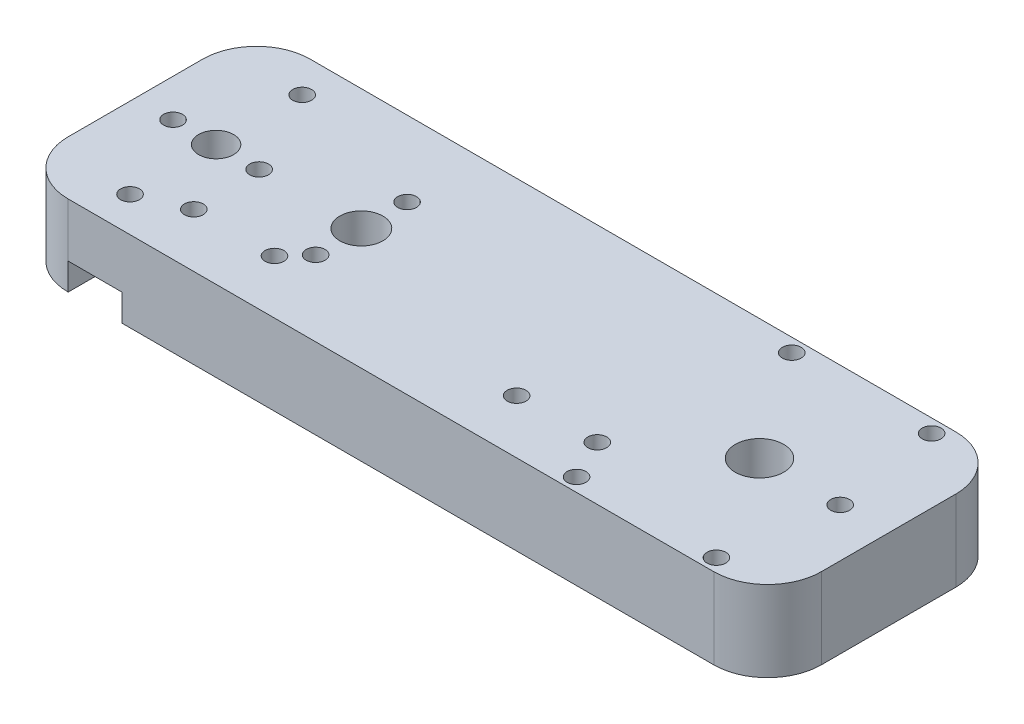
ISO-10303-21;
HEADER;
FILE_DESCRIPTION(('STEP AP214'),'2;1');
FILE_NAME('part.step','',(''),(''),'','','');
FILE_SCHEMA(('AUTOMOTIVE_DESIGN { 1 0 10303 214 1 1 1 1 }'));
ENDSEC;
DATA;
#1=APPLICATION_CONTEXT('core data for automotive mechanical design processes');
#2=APPLICATION_PROTOCOL_DEFINITION('international standard','automotive_design',2000,#1);
#3=PRODUCT_CONTEXT('',#1,'mechanical');
#4=PRODUCT('Part','Part','',(#3));
#5=PRODUCT_RELATED_PRODUCT_CATEGORY('part','',(#4));
#6=PRODUCT_DEFINITION_FORMATION('','',#4);
#7=PRODUCT_DEFINITION_CONTEXT('part definition',#1,'design');
#8=PRODUCT_DEFINITION('design','',#6,#7);
#9=PRODUCT_DEFINITION_SHAPE('','',#8);
#10=(LENGTH_UNIT() NAMED_UNIT(*) SI_UNIT(.MILLI.,.METRE.));
#11=(NAMED_UNIT(*) PLANE_ANGLE_UNIT() SI_UNIT($,.RADIAN.));
#12=(NAMED_UNIT(*) SI_UNIT($,.STERADIAN.) SOLID_ANGLE_UNIT());
#13=UNCERTAINTY_MEASURE_WITH_UNIT(LENGTH_MEASURE(1.E-05),#10,'distance_accuracy_value','');
#14=(GEOMETRIC_REPRESENTATION_CONTEXT(3) GLOBAL_UNCERTAINTY_ASSIGNED_CONTEXT((#13)) GLOBAL_UNIT_ASSIGNED_CONTEXT((#10,
#11,#12)) REPRESENTATION_CONTEXT('',''));
#15=CARTESIAN_POINT('',(0.,0.,0.));
#16=DIRECTION('',(0.,0.,1.));
#17=DIRECTION('',(1.,0.,0.));
#18=AXIS2_PLACEMENT_3D('',#15,#16,#17);
#19=CARTESIAN_POINT('',(0.,0.,0.));
#20=DIRECTION('',(0.,-1.,0.));
#21=DIRECTION('',(0.,0.,-1.));
#22=AXIS2_PLACEMENT_3D('',#19,#20,#21);
#23=PLANE('',#22);
#24=CARTESIAN_POINT('',(46.,0.,0.));
#25=DIRECTION('',(0.,-1.,0.));
#26=DIRECTION('',(0.,0.,-1.));
#27=AXIS2_PLACEMENT_3D('',#24,#25,#26);
#28=CIRCLE('',#27,4.5);
#29=CARTESIAN_POINT('',(46.,0.,-4.5));
#30=VERTEX_POINT('',#29);
#31=EDGE_CURVE('E341',#30,#30,#28,.F.);
#32=ORIENTED_EDGE('',*,*,#31,.T.);
#33=EDGE_LOOP('',(#32));
#34=FACE_BOUND('',#33,.T.);
#35=CARTESIAN_POINT('',(46.,0.,0.));
#36=DIRECTION('',(0.,-1.,0.));
#37=DIRECTION('',(0.,0.,-1.));
#38=AXIS2_PLACEMENT_3D('',#35,#36,#37);
#39=CIRCLE('',#38,8.00000000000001);
#40=CARTESIAN_POINT('',(46.,0.,-8.));
#41=VERTEX_POINT('',#40);
#42=EDGE_CURVE('E491',#41,#41,#39,.F.);
#43=ORIENTED_EDGE('',*,*,#42,.F.);
#44=EDGE_LOOP('',(#43));
#45=FACE_BOUND('',#44,.T.);
#46=ADVANCED_FACE('F49',(#34,#45),#23,.T.);
#47=CARTESIAN_POINT('',(28.3533515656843,0.,12.5));
#48=DIRECTION('',(0.,1.,0.));
#49=DIRECTION('',(0.,0.,1.));
#50=AXIS2_PLACEMENT_3D('',#47,#48,#49);
#51=CIRCLE('',#50,1.75);
#52=CARTESIAN_POINT('',(28.3533515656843,0.,14.25));
#53=VERTEX_POINT('',#52);
#54=EDGE_CURVE('E749',#53,#53,#51,.T.);
#55=ORIENTED_EDGE('',*,*,#54,.T.);
#56=EDGE_LOOP('',(#55));
#57=FACE_BOUND('',#56,.T.);
#58=CARTESIAN_POINT('',(13.3533515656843,0.,12.5000000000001));
#59=DIRECTION('',(0.,1.,0.));
#60=DIRECTION('',(0.,0.,1.));
#61=AXIS2_PLACEMENT_3D('',#58,#59,#60);
#62=CIRCLE('',#61,1.75);
#63=CARTESIAN_POINT('',(13.3533515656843,0.,14.2500000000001));
#64=VERTEX_POINT('',#63);
#65=EDGE_CURVE('E761',#64,#64,#62,.T.);
#66=ORIENTED_EDGE('',*,*,#65,.T.);
#67=EDGE_LOOP('',(#66));
#68=FACE_BOUND('',#67,.T.);
#69=CARTESIAN_POINT('',(-31.6466484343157,0.,12.5000000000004));
#70=DIRECTION('',(0.,1.,0.));
#71=DIRECTION('',(0.,0.,1.));
#72=AXIS2_PLACEMENT_3D('',#69,#70,#71);
#73=CIRCLE('',#72,1.75);
#74=CARTESIAN_POINT('',(-31.6466484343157,0.,14.2500000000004));
#75=VERTEX_POINT('',#74);
#76=EDGE_CURVE('E769',#75,#75,#73,.T.);
#77=ORIENTED_EDGE('',*,*,#76,.T.);
#78=EDGE_LOOP('',(#77));
#79=FACE_BOUND('',#78,.T.);
#80=CARTESIAN_POINT('',(-46.6466484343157,0.,12.5000000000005));
#81=DIRECTION('',(0.,1.,0.));
#82=DIRECTION('',(0.,0.,1.));
#83=AXIS2_PLACEMENT_3D('',#80,#81,#82);
#84=CIRCLE('',#83,1.75);
#85=CARTESIAN_POINT('',(-46.6466484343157,0.,14.2500000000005));
#86=VERTEX_POINT('',#85);
#87=EDGE_CURVE('E777',#86,#86,#84,.T.);
#88=ORIENTED_EDGE('',*,*,#87,.T.);
#89=EDGE_LOOP('',(#88));
#90=FACE_BOUND('',#89,.T.);
#91=CARTESIAN_POINT('',(61.,0.,0.));
#92=DIRECTION('',(0.,-1.,0.));
#93=DIRECTION('',(0.,0.,-1.));
#94=AXIS2_PLACEMENT_3D('',#91,#92,#93);
#95=CIRCLE('',#94,1.75);
#96=CARTESIAN_POINT('',(61.,0.,-1.74999999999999));
#97=VERTEX_POINT('',#96);
#98=EDGE_CURVE('E745',#97,#97,#95,.F.);
#99=ORIENTED_EDGE('',*,*,#98,.T.);
#100=EDGE_LOOP('',(#99));
#101=FACE_BOUND('',#100,.T.);
#102=CARTESIAN_POINT('',(46.,0.,0.));
#103=DIRECTION('',(0.,-1.,0.));
#104=DIRECTION('',(0.,0.,-1.));
#105=AXIS2_PLACEMENT_3D('',#102,#103,#104);
#106=CIRCLE('',#105,12.5);
#107=CARTESIAN_POINT('',(46.,0.,-12.5));
#108=VERTEX_POINT('',#107);
#109=EDGE_CURVE('E11',#108,#108,#106,.F.);
#110=ORIENTED_EDGE('',*,*,#109,.T.);
#111=EDGE_LOOP('',(#110));
#112=FACE_BOUND('',#111,.T.);
#113=CARTESIAN_POINT('',(-28.,0.,8.5));
#114=DIRECTION('',(0.,-1.,0.));
#115=DIRECTION('',(0.,0.,-1.));
#116=AXIS2_PLACEMENT_3D('',#113,#114,#115);
#117=CIRCLE('',#116,1.75);
#118=CARTESIAN_POINT('',(-28.,0.,6.75));
#119=VERTEX_POINT('',#118);
#120=EDGE_CURVE('E308',#119,#119,#117,.T.);
#121=ORIENTED_EDGE('',*,*,#120,.F.);
#122=EDGE_LOOP('',(#121));
#123=FACE_BOUND('',#122,.T.);
#124=CARTESIAN_POINT('',(-28.,0.,0.));
#125=DIRECTION('',(0.,-1.,0.));
#126=DIRECTION('',(0.,0.,-1.));
#127=AXIS2_PLACEMENT_3D('',#124,#125,#126);
#128=CIRCLE('',#127,3.99999999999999);
#129=CARTESIAN_POINT('',(-28.,0.,-3.99999999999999));
#130=VERTEX_POINT('',#129);
#131=EDGE_CURVE('E318',#130,#130,#128,.T.);
#132=ORIENTED_EDGE('',*,*,#131,.F.);
#133=EDGE_LOOP('',(#132));
#134=FACE_BOUND('',#133,.T.);
#135=CARTESIAN_POINT('',(-28.,0.,-8.5));
#136=DIRECTION('',(0.,-1.,0.));
#137=DIRECTION('',(0.,0.,-1.));
#138=AXIS2_PLACEMENT_3D('',#135,#136,#137);
#139=CIRCLE('',#138,1.75);
#140=CARTESIAN_POINT('',(-28.,0.,-10.25));
#141=VERTEX_POINT('',#140);
#142=EDGE_CURVE('E307',#141,#141,#139,.T.);
#143=ORIENTED_EDGE('',*,*,#142,.F.);
#144=EDGE_LOOP('',(#143));
#145=FACE_BOUND('',#144,.T.);
#146=CARTESIAN_POINT('',(-47.,0.,0.));
#147=DIRECTION('',(0.,-1.,0.));
#148=DIRECTION('',(0.,0.,-1.));
#149=AXIS2_PLACEMENT_3D('',#146,#147,#148);
#150=CIRCLE('',#149,1.75);
#151=CARTESIAN_POINT('',(-47.,0.,-1.74999999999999));
#152=VERTEX_POINT('',#151);
#153=EDGE_CURVE('E332',#152,#152,#150,.T.);
#154=ORIENTED_EDGE('',*,*,#153,.F.);
#155=EDGE_LOOP('',(#154));
#156=FACE_BOUND('',#155,.T.);
#157=CARTESIAN_POINT('',(-55.,0.,16.));
#158=DIRECTION('',(0.,-1.,0.));
#159=DIRECTION('',(0.,0.,-1.));
#160=AXIS2_PLACEMENT_3D('',#157,#158,#159);
#161=CIRCLE('',#160,1.75);
#162=CARTESIAN_POINT('',(-55.,0.,14.25));
#163=VERTEX_POINT('',#162);
#164=EDGE_CURVE('E342',#163,#163,#161,.T.);
#165=ORIENTED_EDGE('',*,*,#164,.F.);
#166=EDGE_LOOP('',(#165));
#167=FACE_BOUND('',#166,.T.);
#168=CARTESIAN_POINT('',(-63.,0.,0.));
#169=DIRECTION('',(0.,-1.,0.));
#170=DIRECTION('',(0.,0.,-1.));
#171=AXIS2_PLACEMENT_3D('',#168,#169,#170);
#172=CIRCLE('',#171,1.75);
#173=CARTESIAN_POINT('',(-63.,0.,-1.75));
#174=VERTEX_POINT('',#173);
#175=EDGE_CURVE('E350',#174,#174,#172,.T.);
#176=ORIENTED_EDGE('',*,*,#175,.F.);
#177=EDGE_LOOP('',(#176));
#178=FACE_BOUND('',#177,.T.);
#179=CARTESIAN_POINT('',(-55.,0.,-16.));
#180=DIRECTION('',(0.,-1.,0.));
#181=DIRECTION('',(0.,0.,-1.));
#182=AXIS2_PLACEMENT_3D('',#179,#180,#181);
#183=CIRCLE('',#182,1.75);
#184=CARTESIAN_POINT('',(-55.,0.,-17.75));
#185=VERTEX_POINT('',#184);
#186=EDGE_CURVE('E317',#185,#185,#183,.T.);
#187=ORIENTED_EDGE('',*,*,#186,.F.);
#188=EDGE_LOOP('',(#187));
#189=FACE_BOUND('',#188,.T.);
#190=CARTESIAN_POINT('',(-55.,0.,0.));
#191=DIRECTION('',(0.,-1.,0.));
#192=DIRECTION('',(0.,0.,-1.));
#193=AXIS2_PLACEMENT_3D('',#190,#191,#192);
#194=CIRCLE('',#193,3.25000000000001);
#195=CARTESIAN_POINT('',(-55.,0.,-3.25000000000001));
#196=VERTEX_POINT('',#195);
#197=EDGE_CURVE('E368',#196,#196,#194,.T.);
#198=ORIENTED_EDGE('',*,*,#197,.F.);
#199=EDGE_LOOP('',(#198));
#200=FACE_BOUND('',#199,.T.);
#201=DIRECTION('',(0.,0.,-1.));
#202=VECTOR('',#201,1.);
#203=CARTESIAN_POINT('',(67.,0.,-17.5));
#204=LINE('',#203,#202);
#205=CARTESIAN_POINT('',(67.,0.,7.49999999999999));
#206=VERTEX_POINT('',#205);
#207=CARTESIAN_POINT('',(67.,0.,-7.5));
#208=VERTEX_POINT('',#207);
#209=EDGE_CURVE('E282',#206,#208,#204,.T.);
#210=ORIENTED_EDGE('',*,*,#209,.F.);
#211=CARTESIAN_POINT('',(57.,0.,7.49999999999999));
#212=DIRECTION('',(0.,-1.,0.));
#213=DIRECTION('',(0.,0.,-1.));
#214=AXIS2_PLACEMENT_3D('',#211,#212,#213);
#215=CIRCLE('',#214,10.);
#216=CARTESIAN_POINT('',(57.,0.,17.5));
#217=VERTEX_POINT('',#216);
#218=EDGE_CURVE('E464',#206,#217,#215,.T.);
#219=ORIENTED_EDGE('',*,*,#218,.T.);
#220=DIRECTION('',(1.,0.,0.));
#221=VECTOR('',#220,1.);
#222=CARTESIAN_POINT('',(-50.,0.,17.5));
#223=LINE('',#222,#221);
#224=CARTESIAN_POINT('',(-50.,0.,17.5));
#225=VERTEX_POINT('',#224);
#226=EDGE_CURVE('E278',#225,#217,#223,.T.);
#227=ORIENTED_EDGE('',*,*,#226,.F.);
#228=DIRECTION('',(0.,0.,-1.));
#229=VECTOR('',#228,1.);
#230=CARTESIAN_POINT('',(-50.,0.,22.5));
#231=LINE('',#230,#229);
#232=CARTESIAN_POINT('',(-50.,0.,22.5));
#233=VERTEX_POINT('',#232);
#234=EDGE_CURVE('E237',#233,#225,#231,.T.);
#235=ORIENTED_EDGE('',*,*,#234,.F.);
#236=DIRECTION('',(1.,0.,0.));
#237=VECTOR('',#236,1.);
#238=CARTESIAN_POINT('',(-70.,0.,22.5));
#239=LINE('',#238,#237);
#240=CARTESIAN_POINT('',(-60.,0.,22.5));
#241=VERTEX_POINT('',#240);
#242=EDGE_CURVE('E220',#241,#233,#239,.T.);
#243=ORIENTED_EDGE('',*,*,#242,.F.);
#244=DIRECTION('',(0.,0.,1.));
#245=VECTOR('',#244,1.);
#246=CARTESIAN_POINT('',(-60.,0.,22.5));
#247=LINE('',#246,#245);
#248=CARTESIAN_POINT('',(-60.,0.,17.5));
#249=VERTEX_POINT('',#248);
#250=EDGE_CURVE('E210',#249,#241,#247,.T.);
#251=ORIENTED_EDGE('',*,*,#250,.F.);
#252=CARTESIAN_POINT('',(-57.,0.,7.96060798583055));
#253=DIRECTION('',(0.,-1.,0.));
#254=DIRECTION('',(0.,0.,-1.));
#255=AXIS2_PLACEMENT_3D('',#252,#253,#254);
#256=CIRCLE('',#255,10.);
#257=CARTESIAN_POINT('',(-67.,0.,7.96060798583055));
#258=VERTEX_POINT('',#257);
#259=EDGE_CURVE('E193',#249,#258,#256,.T.);
#260=ORIENTED_EDGE('',*,*,#259,.T.);
#261=DIRECTION('',(0.,0.,1.));
#262=VECTOR('',#261,1.);
#263=CARTESIAN_POINT('',(-67.,0.,-17.5));
#264=LINE('',#263,#262);
#265=CARTESIAN_POINT('',(-67.,0.,-7.96060798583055));
#266=VERTEX_POINT('',#265);
#267=EDGE_CURVE('E222',#266,#258,#264,.T.);
#268=ORIENTED_EDGE('',*,*,#267,.F.);
#269=CARTESIAN_POINT('',(-57.,0.,-7.96060798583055));
#270=DIRECTION('',(0.,-1.,0.));
#271=DIRECTION('',(0.,0.,-1.));
#272=AXIS2_PLACEMENT_3D('',#269,#270,#271);
#273=CIRCLE('',#272,10.);
#274=CARTESIAN_POINT('',(-60.,0.,-17.5));
#275=VERTEX_POINT('',#274);
#276=EDGE_CURVE('E202',#266,#275,#273,.T.);
#277=ORIENTED_EDGE('',*,*,#276,.T.);
#278=DIRECTION('',(0.,0.,1.));
#279=VECTOR('',#278,1.);
#280=CARTESIAN_POINT('',(-60.,0.,-22.5));
#281=LINE('',#280,#279);
#282=CARTESIAN_POINT('',(-60.,0.,-22.5));
#283=VERTEX_POINT('',#282);
#284=EDGE_CURVE('E227',#283,#275,#281,.T.);
#285=ORIENTED_EDGE('',*,*,#284,.F.);
#286=DIRECTION('',(-1.,0.,0.));
#287=VECTOR('',#286,1.);
#288=CARTESIAN_POINT('',(-70.,0.,-22.5));
#289=LINE('',#288,#287);
#290=CARTESIAN_POINT('',(-50.,0.,-22.5));
#291=VERTEX_POINT('',#290);
#292=EDGE_CURVE('E379',#291,#283,#289,.T.);
#293=ORIENTED_EDGE('',*,*,#292,.F.);
#294=DIRECTION('',(0.,0.,-1.));
#295=VECTOR('',#294,1.);
#296=CARTESIAN_POINT('',(-50.,0.,-22.5));
#297=LINE('',#296,#295);
#298=CARTESIAN_POINT('',(-50.,0.,-17.5));
#299=VERTEX_POINT('',#298);
#300=EDGE_CURVE('E249',#299,#291,#297,.T.);
#301=ORIENTED_EDGE('',*,*,#300,.F.);
#302=DIRECTION('',(-1.,0.,0.));
#303=VECTOR('',#302,1.);
#304=CARTESIAN_POINT('',(-50.,0.,-17.5));
#305=LINE('',#304,#303);
#306=CARTESIAN_POINT('',(57.,0.,-17.5));
#307=VERTEX_POINT('',#306);
#308=EDGE_CURVE('E286',#307,#299,#305,.T.);
#309=ORIENTED_EDGE('',*,*,#308,.F.);
#310=CARTESIAN_POINT('',(57.,0.,-7.5));
#311=DIRECTION('',(0.,-1.,0.));
#312=DIRECTION('',(0.,0.,-1.));
#313=AXIS2_PLACEMENT_3D('',#310,#311,#312);
#314=CIRCLE('',#313,10.);
#315=EDGE_CURVE('E461',#307,#208,#314,.T.);
#316=ORIENTED_EDGE('',*,*,#315,.T.);
#317=EDGE_LOOP('',(#210,#219,#227,#235,#243,#251,#260,#268,#277,#285,#293,#301,#309,#316));
#318=FACE_BOUND('',#317,.T.);
#319=ADVANCED_FACE('F218',(#57,#68,#79,#90,#101,#112,#123,#134,#145,#156,#167,#178,#189,#200,
#318),#23,.T.);
#320=CARTESIAN_POINT('',(70.,10.,22.5));
#321=DIRECTION('',(-1.,0.,0.));
#322=DIRECTION('',(0.,0.,1.));
#323=AXIS2_PLACEMENT_3D('',#320,#321,#322);
#324=PLANE('',#323);
#325=DIRECTION('',(0.,0.,1.));
#326=VECTOR('',#325,1.);
#327=CARTESIAN_POINT('',(70.,-5.,-22.5));
#328=LINE('',#327,#326);
#329=CARTESIAN_POINT('',(70.,-5.,-12.5));
#330=VERTEX_POINT('',#329);
#331=CARTESIAN_POINT('',(70.,-5.,12.5));
#332=VERTEX_POINT('',#331);
#333=EDGE_CURVE('E270',#330,#332,#328,.T.);
#334=ORIENTED_EDGE('',*,*,#333,.F.);
#335=DIRECTION('',(0.,-1.,0.));
#336=VECTOR('',#335,1.);
#337=CARTESIAN_POINT('',(70.,10.,-12.5));
#338=LINE('',#337,#336);
#339=CARTESIAN_POINT('',(70.,10.,-12.5));
#340=VERTEX_POINT('',#339);
#341=EDGE_CURVE('E450',#330,#340,#338,.F.);
#342=ORIENTED_EDGE('',*,*,#341,.T.);
#343=DIRECTION('',(0.,0.,-1.));
#344=VECTOR('',#343,1.);
#345=CARTESIAN_POINT('',(70.,10.,22.5));
#346=LINE('',#345,#344);
#347=CARTESIAN_POINT('',(70.,10.,12.5));
#348=VERTEX_POINT('',#347);
#349=EDGE_CURVE('E380',#348,#340,#346,.T.);
#350=ORIENTED_EDGE('',*,*,#349,.F.);
#351=DIRECTION('',(0.,-1.,0.));
#352=VECTOR('',#351,1.);
#353=CARTESIAN_POINT('',(70.,10.,12.5));
#354=LINE('',#353,#352);
#355=EDGE_CURVE('E446',#348,#332,#354,.T.);
#356=ORIENTED_EDGE('',*,*,#355,.T.);
#357=EDGE_LOOP('',(#334,#342,#350,#356));
#358=FACE_BOUND('',#357,.T.);
#359=ADVANCED_FACE('F521',(#358),#324,.F.);
#360=CARTESIAN_POINT('',(-70.,10.,-22.5));
#361=DIRECTION('',(0.,0.,1.));
#362=DIRECTION('',(1.,0.,0.));
#363=AXIS2_PLACEMENT_3D('',#360,#361,#362);
#364=PLANE('',#363);
#365=ORIENTED_EDGE('',*,*,#292,.T.);
#366=DIRECTION('',(0.,-1.,0.));
#367=VECTOR('',#366,1.);
#368=CARTESIAN_POINT('',(-60.,10.,-22.5));
#369=LINE('',#368,#367);
#370=CARTESIAN_POINT('',(-60.,10.,-22.5));
#371=VERTEX_POINT('',#370);
#372=EDGE_CURVE('E437',#283,#371,#369,.F.);
#373=ORIENTED_EDGE('',*,*,#372,.T.);
#374=DIRECTION('',(-1.,0.,0.));
#375=VECTOR('',#374,1.);
#376=CARTESIAN_POINT('',(-70.,10.,-22.5));
#377=LINE('',#376,#375);
#378=CARTESIAN_POINT('',(60.,10.,-22.5));
#379=VERTEX_POINT('',#378);
#380=EDGE_CURVE('E384',#379,#371,#377,.T.);
#381=ORIENTED_EDGE('',*,*,#380,.F.);
#382=DIRECTION('',(0.,-1.,0.));
#383=VECTOR('',#382,1.);
#384=CARTESIAN_POINT('',(60.,10.,-22.5));
#385=LINE('',#384,#383);
#386=CARTESIAN_POINT('',(60.,-5.,-22.5));
#387=VERTEX_POINT('',#386);
#388=EDGE_CURVE('E433',#379,#387,#385,.T.);
#389=ORIENTED_EDGE('',*,*,#388,.T.);
#390=DIRECTION('',(1.,0.,0.));
#391=VECTOR('',#390,1.);
#392=CARTESIAN_POINT('',(-50.,-5.,-22.5));
#393=LINE('',#392,#391);
#394=CARTESIAN_POINT('',(-50.,-5.,-22.5));
#395=VERTEX_POINT('',#394);
#396=EDGE_CURVE('E266',#395,#387,#393,.T.);
#397=ORIENTED_EDGE('',*,*,#396,.F.);
#398=DIRECTION('',(0.,1.,0.));
#399=VECTOR('',#398,1.);
#400=CARTESIAN_POINT('',(-50.,-5.,-22.5));
#401=LINE('',#400,#399);
#402=EDGE_CURVE('E274',#395,#291,#401,.T.);
#403=ORIENTED_EDGE('',*,*,#402,.T.);
#404=EDGE_LOOP('',(#365,#373,#381,#389,#397,#403));
#405=FACE_BOUND('',#404,.T.);
#406=ADVANCED_FACE('F535',(#405),#364,.F.);
#407=CARTESIAN_POINT('',(-70.,10.,22.5));
#408=DIRECTION('',(1.,0.,0.));
#409=DIRECTION('',(0.,0.,-1.));
#410=AXIS2_PLACEMENT_3D('',#407,#408,#409);
#411=PLANE('',#410);
#412=DIRECTION('',(0.,0.,-1.));
#413=VECTOR('',#412,1.);
#414=CARTESIAN_POINT('',(-70.,-5.,-22.5));
#415=LINE('',#414,#413);
#416=CARTESIAN_POINT('',(-70.,-5.,12.5));
#417=VERTEX_POINT('',#416);
#418=CARTESIAN_POINT('',(-70.,-5.,-12.5));
#419=VERTEX_POINT('',#418);
#420=EDGE_CURVE('E223',#417,#419,#415,.T.);
#421=ORIENTED_EDGE('',*,*,#420,.F.);
#422=DIRECTION('',(0.,-1.,0.));
#423=VECTOR('',#422,1.);
#424=CARTESIAN_POINT('',(-70.,10.,12.5));
#425=LINE('',#424,#423);
#426=CARTESIAN_POINT('',(-70.,10.,12.5));
#427=VERTEX_POINT('',#426);
#428=EDGE_CURVE('E418',#417,#427,#425,.F.);
#429=ORIENTED_EDGE('',*,*,#428,.T.);
#430=DIRECTION('',(0.,0.,1.));
#431=VECTOR('',#430,1.);
#432=CARTESIAN_POINT('',(-70.,10.,22.5));
#433=LINE('',#432,#431);
#434=CARTESIAN_POINT('',(-70.,10.,-12.5));
#435=VERTEX_POINT('',#434);
#436=EDGE_CURVE('E388',#435,#427,#433,.T.);
#437=ORIENTED_EDGE('',*,*,#436,.F.);
#438=DIRECTION('',(0.,-1.,0.));
#439=VECTOR('',#438,1.);
#440=CARTESIAN_POINT('',(-70.,10.,-12.5));
#441=LINE('',#440,#439);
#442=EDGE_CURVE('E414',#435,#419,#441,.T.);
#443=ORIENTED_EDGE('',*,*,#442,.T.);
#444=EDGE_LOOP('',(#421,#429,#437,#443));
#445=FACE_BOUND('',#444,.T.);
#446=ADVANCED_FACE('F531',(#445),#411,.F.);
#447=CARTESIAN_POINT('',(-70.,10.,22.5));
#448=DIRECTION('',(0.,0.,-1.));
#449=DIRECTION('',(-1.,0.,0.));
#450=AXIS2_PLACEMENT_3D('',#447,#448,#449);
#451=PLANE('',#450);
#452=DIRECTION('',(1.,0.,0.));
#453=VECTOR('',#452,1.);
#454=CARTESIAN_POINT('',(-70.,10.,22.5));
#455=LINE('',#454,#453);
#456=CARTESIAN_POINT('',(-60.,10.,22.5));
#457=VERTEX_POINT('',#456);
#458=CARTESIAN_POINT('',(60.,10.,22.5));
#459=VERTEX_POINT('',#458);
#460=EDGE_CURVE('E392',#457,#459,#455,.T.);
#461=ORIENTED_EDGE('',*,*,#460,.F.);
#462=DIRECTION('',(0.,-1.,0.));
#463=VECTOR('',#462,1.);
#464=CARTESIAN_POINT('',(-60.,10.,22.5));
#465=LINE('',#464,#463);
#466=EDGE_CURVE('E404',#457,#241,#465,.T.);
#467=ORIENTED_EDGE('',*,*,#466,.T.);
#468=ORIENTED_EDGE('',*,*,#242,.T.);
#469=DIRECTION('',(0.,1.,0.));
#470=VECTOR('',#469,1.);
#471=CARTESIAN_POINT('',(-50.,-5.,22.5));
#472=LINE('',#471,#470);
#473=CARTESIAN_POINT('',(-50.,-5.,22.5));
#474=VERTEX_POINT('',#473);
#475=EDGE_CURVE('E303',#474,#233,#472,.T.);
#476=ORIENTED_EDGE('',*,*,#475,.F.);
#477=DIRECTION('',(-1.,0.,0.));
#478=VECTOR('',#477,1.);
#479=CARTESIAN_POINT('',(-50.,-5.,22.5));
#480=LINE('',#479,#478);
#481=CARTESIAN_POINT('',(60.,-5.,22.5));
#482=VERTEX_POINT('',#481);
#483=EDGE_CURVE('E245',#482,#474,#480,.T.);
#484=ORIENTED_EDGE('',*,*,#483,.F.);
#485=DIRECTION('',(0.,-1.,0.));
#486=VECTOR('',#485,1.);
#487=CARTESIAN_POINT('',(60.,10.,22.5));
#488=LINE('',#487,#486);
#489=EDGE_CURVE('E396',#482,#459,#488,.F.);
#490=ORIENTED_EDGE('',*,*,#489,.T.);
#491=EDGE_LOOP('',(#461,#467,#468,#476,#484,#490));
#492=FACE_BOUND('',#491,.T.);
#493=ADVANCED_FACE('F528',(#492),#451,.F.);
#494=CARTESIAN_POINT('',(0.,10.,0.));
#495=DIRECTION('',(0.,-1.,0.));
#496=DIRECTION('',(0.,0.,-1.));
#497=AXIS2_PLACEMENT_3D('',#494,#495,#496);
#498=PLANE('',#497);
#499=CARTESIAN_POINT('',(28.3533515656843,10.,12.5));
#500=DIRECTION('',(0.,1.,0.));
#501=DIRECTION('',(0.,0.,1.));
#502=AXIS2_PLACEMENT_3D('',#499,#500,#501);
#503=CIRCLE('',#502,1.75);
#504=CARTESIAN_POINT('',(28.3533515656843,10.,14.25));
#505=VERTEX_POINT('',#504);
#506=EDGE_CURVE('E753',#505,#505,#503,.T.);
#507=ORIENTED_EDGE('',*,*,#506,.F.);
#508=EDGE_LOOP('',(#507));
#509=FACE_BOUND('',#508,.T.);
#510=CARTESIAN_POINT('',(13.3533515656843,10.,12.5000000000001));
#511=DIRECTION('',(0.,1.,0.));
#512=DIRECTION('',(0.,0.,1.));
#513=AXIS2_PLACEMENT_3D('',#510,#511,#512);
#514=CIRCLE('',#513,1.75);
#515=CARTESIAN_POINT('',(13.3533515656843,10.,14.2500000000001));
#516=VERTEX_POINT('',#515);
#517=EDGE_CURVE('E757',#516,#516,#514,.T.);
#518=ORIENTED_EDGE('',*,*,#517,.F.);
#519=EDGE_LOOP('',(#518));
#520=FACE_BOUND('',#519,.T.);
#521=CARTESIAN_POINT('',(-31.6466484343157,10.,12.5000000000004));
#522=DIRECTION('',(0.,1.,0.));
#523=DIRECTION('',(0.,0.,1.));
#524=AXIS2_PLACEMENT_3D('',#521,#522,#523);
#525=CIRCLE('',#524,1.75);
#526=CARTESIAN_POINT('',(-31.6466484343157,10.,14.2500000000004));
#527=VERTEX_POINT('',#526);
#528=EDGE_CURVE('E765',#527,#527,#525,.T.);
#529=ORIENTED_EDGE('',*,*,#528,.F.);
#530=EDGE_LOOP('',(#529));
#531=FACE_BOUND('',#530,.T.);
#532=CARTESIAN_POINT('',(-46.6466484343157,10.,12.5000000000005));
#533=DIRECTION('',(0.,1.,0.));
#534=DIRECTION('',(0.,0.,1.));
#535=AXIS2_PLACEMENT_3D('',#532,#533,#534);
#536=CIRCLE('',#535,1.75);
#537=CARTESIAN_POINT('',(-46.6466484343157,10.,14.2500000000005));
#538=VERTEX_POINT('',#537);
#539=EDGE_CURVE('E773',#538,#538,#536,.T.);
#540=ORIENTED_EDGE('',*,*,#539,.F.);
#541=EDGE_LOOP('',(#540));
#542=FACE_BOUND('',#541,.T.);
#543=CARTESIAN_POINT('',(61.,10.,0.));
#544=DIRECTION('',(0.,1.,0.));
#545=DIRECTION('',(0.,0.,1.));
#546=AXIS2_PLACEMENT_3D('',#543,#544,#545);
#547=CIRCLE('',#546,1.75);
#548=CARTESIAN_POINT('',(61.,10.,1.75000000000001));
#549=VERTEX_POINT('',#548);
#550=EDGE_CURVE('E741',#549,#549,#547,.T.);
#551=ORIENTED_EDGE('',*,*,#550,.F.);
#552=EDGE_LOOP('',(#551));
#553=FACE_BOUND('',#552,.T.);
#554=CARTESIAN_POINT('',(58.,10.,-20.));
#555=DIRECTION('',(0.,-1.,0.));
#556=DIRECTION('',(0.,0.,-1.));
#557=AXIS2_PLACEMENT_3D('',#554,#555,#556);
#558=CIRCLE('',#557,1.75);
#559=CARTESIAN_POINT('',(58.,10.,-21.75));
#560=VERTEX_POINT('',#559);
#561=EDGE_CURVE('E729',#560,#560,#558,.T.);
#562=ORIENTED_EDGE('',*,*,#561,.T.);
#563=EDGE_LOOP('',(#562));
#564=FACE_BOUND('',#563,.T.);
#565=CARTESIAN_POINT('',(32.,10.,-20.));
#566=DIRECTION('',(0.,-1.,0.));
#567=DIRECTION('',(0.,0.,-1.));
#568=AXIS2_PLACEMENT_3D('',#565,#566,#567);
#569=CIRCLE('',#568,1.74999999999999);
#570=CARTESIAN_POINT('',(32.,10.,-21.75));
#571=VERTEX_POINT('',#570);
#572=EDGE_CURVE('E721',#571,#571,#569,.T.);
#573=ORIENTED_EDGE('',*,*,#572,.T.);
#574=EDGE_LOOP('',(#573));
#575=FACE_BOUND('',#574,.T.);
#576=CARTESIAN_POINT('',(32.,10.,20.));
#577=DIRECTION('',(0.,-1.,0.));
#578=DIRECTION('',(0.,0.,-1.));
#579=AXIS2_PLACEMENT_3D('',#576,#577,#578);
#580=CIRCLE('',#579,1.74999999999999);
#581=CARTESIAN_POINT('',(32.,10.,18.25));
#582=VERTEX_POINT('',#581);
#583=EDGE_CURVE('E713',#582,#582,#580,.T.);
#584=ORIENTED_EDGE('',*,*,#583,.T.);
#585=EDGE_LOOP('',(#584));
#586=FACE_BOUND('',#585,.T.);
#587=CARTESIAN_POINT('',(58.,10.,20.));
#588=DIRECTION('',(0.,-1.,0.));
#589=DIRECTION('',(0.,0.,-1.));
#590=AXIS2_PLACEMENT_3D('',#587,#588,#589);
#591=CIRCLE('',#590,1.75);
#592=CARTESIAN_POINT('',(58.,10.,18.25));
#593=VERTEX_POINT('',#592);
#594=EDGE_CURVE('E701',#593,#593,#591,.T.);
#595=ORIENTED_EDGE('',*,*,#594,.T.);
#596=EDGE_LOOP('',(#595));
#597=FACE_BOUND('',#596,.T.);
#598=CARTESIAN_POINT('',(-28.,10.,8.5));
#599=DIRECTION('',(0.,-1.,0.));
#600=DIRECTION('',(0.,0.,-1.));
#601=AXIS2_PLACEMENT_3D('',#598,#599,#600);
#602=CIRCLE('',#601,1.75);
#603=CARTESIAN_POINT('',(-28.,10.,6.75));
#604=VERTEX_POINT('',#603);
#605=EDGE_CURVE('E312',#604,#604,#602,.F.);
#606=ORIENTED_EDGE('',*,*,#605,.F.);
#607=EDGE_LOOP('',(#606));
#608=FACE_BOUND('',#607,.T.);
#609=CARTESIAN_POINT('',(-28.,10.,0.));
#610=DIRECTION('',(0.,-1.,0.));
#611=DIRECTION('',(0.,0.,-1.));
#612=AXIS2_PLACEMENT_3D('',#609,#610,#611);
#613=CIRCLE('',#612,3.99999999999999);
#614=CARTESIAN_POINT('',(-28.,10.,-3.99999999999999));
#615=VERTEX_POINT('',#614);
#616=EDGE_CURVE('E313',#615,#615,#613,.F.);
#617=ORIENTED_EDGE('',*,*,#616,.F.);
#618=EDGE_LOOP('',(#617));
#619=FACE_BOUND('',#618,.T.);
#620=CARTESIAN_POINT('',(-28.,10.,-8.5));
#621=DIRECTION('',(0.,-1.,0.));
#622=DIRECTION('',(0.,0.,-1.));
#623=AXIS2_PLACEMENT_3D('',#620,#621,#622);
#624=CIRCLE('',#623,1.75);
#625=CARTESIAN_POINT('',(-28.,10.,-10.25));
#626=VERTEX_POINT('',#625);
#627=EDGE_CURVE('E322',#626,#626,#624,.F.);
#628=ORIENTED_EDGE('',*,*,#627,.F.);
#629=EDGE_LOOP('',(#628));
#630=FACE_BOUND('',#629,.T.);
#631=CARTESIAN_POINT('',(-47.,10.,0.));
#632=DIRECTION('',(0.,-1.,0.));
#633=DIRECTION('',(0.,0.,-1.));
#634=AXIS2_PLACEMENT_3D('',#631,#632,#633);
#635=CIRCLE('',#634,1.75);
#636=CARTESIAN_POINT('',(-47.,10.,-1.74999999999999));
#637=VERTEX_POINT('',#636);
#638=EDGE_CURVE('E336',#637,#637,#635,.F.);
#639=ORIENTED_EDGE('',*,*,#638,.F.);
#640=EDGE_LOOP('',(#639));
#641=FACE_BOUND('',#640,.T.);
#642=CARTESIAN_POINT('',(-55.,10.,16.));
#643=DIRECTION('',(0.,-1.,0.));
#644=DIRECTION('',(0.,0.,-1.));
#645=AXIS2_PLACEMENT_3D('',#642,#643,#644);
#646=CIRCLE('',#645,1.75);
#647=CARTESIAN_POINT('',(-55.,10.,14.25));
#648=VERTEX_POINT('',#647);
#649=EDGE_CURVE('E337',#648,#648,#646,.F.);
#650=ORIENTED_EDGE('',*,*,#649,.F.);
#651=EDGE_LOOP('',(#650));
#652=FACE_BOUND('',#651,.T.);
#653=CARTESIAN_POINT('',(-63.,10.,0.));
#654=DIRECTION('',(0.,-1.,0.));
#655=DIRECTION('',(0.,0.,-1.));
#656=AXIS2_PLACEMENT_3D('',#653,#654,#655);
#657=CIRCLE('',#656,1.75);
#658=CARTESIAN_POINT('',(-63.,10.,-1.75));
#659=VERTEX_POINT('',#658);
#660=EDGE_CURVE('E346',#659,#659,#657,.F.);
#661=ORIENTED_EDGE('',*,*,#660,.F.);
#662=EDGE_LOOP('',(#661));
#663=FACE_BOUND('',#662,.T.);
#664=CARTESIAN_POINT('',(-55.,10.,-16.));
#665=DIRECTION('',(0.,-1.,0.));
#666=DIRECTION('',(0.,0.,-1.));
#667=AXIS2_PLACEMENT_3D('',#664,#665,#666);
#668=CIRCLE('',#667,1.75);
#669=CARTESIAN_POINT('',(-55.,10.,-17.75));
#670=VERTEX_POINT('',#669);
#671=EDGE_CURVE('E354',#670,#670,#668,.F.);
#672=ORIENTED_EDGE('',*,*,#671,.F.);
#673=EDGE_LOOP('',(#672));
#674=FACE_BOUND('',#673,.T.);
#675=CARTESIAN_POINT('',(46.,10.,0.));
#676=DIRECTION('',(0.,1.,0.));
#677=DIRECTION('',(0.,0.,1.));
#678=AXIS2_PLACEMENT_3D('',#675,#676,#677);
#679=CIRCLE('',#678,4.5);
#680=CARTESIAN_POINT('',(46.,10.,4.50000000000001));
#681=VERTEX_POINT('',#680);
#682=EDGE_CURVE('E364',#681,#681,#679,.T.);
#683=ORIENTED_EDGE('',*,*,#682,.F.);
#684=EDGE_LOOP('',(#683));
#685=FACE_BOUND('',#684,.T.);
#686=CARTESIAN_POINT('',(-55.,10.,0.));
#687=DIRECTION('',(0.,-1.,0.));
#688=DIRECTION('',(0.,0.,-1.));
#689=AXIS2_PLACEMENT_3D('',#686,#687,#688);
#690=CIRCLE('',#689,3.25000000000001);
#691=CARTESIAN_POINT('',(-55.,10.,-3.25000000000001));
#692=VERTEX_POINT('',#691);
#693=EDGE_CURVE('E375',#692,#692,#690,.F.);
#694=ORIENTED_EDGE('',*,*,#693,.F.);
#695=EDGE_LOOP('',(#694));
#696=FACE_BOUND('',#695,.T.);
#697=ORIENTED_EDGE('',*,*,#436,.T.);
#698=CARTESIAN_POINT('',(-60.,10.,12.5));
#699=DIRECTION('',(0.,-1.,0.));
#700=DIRECTION('',(0.,0.,-1.));
#701=AXIS2_PLACEMENT_3D('',#698,#699,#700);
#702=CIRCLE('',#701,10.);
#703=EDGE_CURVE('E430',#427,#457,#702,.F.);
#704=ORIENTED_EDGE('',*,*,#703,.T.);
#705=ORIENTED_EDGE('',*,*,#460,.T.);
#706=CARTESIAN_POINT('',(60.,10.,12.5));
#707=DIRECTION('',(0.,-1.,0.));
#708=DIRECTION('',(0.,0.,-1.));
#709=AXIS2_PLACEMENT_3D('',#706,#707,#708);
#710=CIRCLE('',#709,10.);
#711=EDGE_CURVE('E421',#459,#348,#710,.F.);
#712=ORIENTED_EDGE('',*,*,#711,.T.);
#713=ORIENTED_EDGE('',*,*,#349,.T.);
#714=CARTESIAN_POINT('',(60.,10.,-12.5));
#715=DIRECTION('',(0.,-1.,0.));
#716=DIRECTION('',(0.,0.,-1.));
#717=AXIS2_PLACEMENT_3D('',#714,#715,#716);
#718=CIRCLE('',#717,10.);
#719=EDGE_CURVE('E424',#340,#379,#718,.F.);
#720=ORIENTED_EDGE('',*,*,#719,.T.);
#721=ORIENTED_EDGE('',*,*,#380,.T.);
#722=CARTESIAN_POINT('',(-60.,10.,-12.5));
#723=DIRECTION('',(0.,-1.,0.));
#724=DIRECTION('',(0.,0.,-1.));
#725=AXIS2_PLACEMENT_3D('',#722,#723,#724);
#726=CIRCLE('',#725,10.);
#727=EDGE_CURVE('E427',#371,#435,#726,.F.);
#728=ORIENTED_EDGE('',*,*,#727,.T.);
#729=EDGE_LOOP('',(#697,#704,#705,#712,#713,#720,#721,#728));
#730=FACE_BOUND('',#729,.T.);
#731=ADVANCED_FACE('F526',(#509,#520,#531,#542,#553,#564,#575,#586,#597,#608,#619,#630,#641,
#652,#663,#674,#685,#696,#730),#498,.F.);
#732=CARTESIAN_POINT('',(-55.,10.001,0.));
#733=DIRECTION('',(0.,-1.,0.));
#734=DIRECTION('',(0.,0.,-1.));
#735=AXIS2_PLACEMENT_3D('',#732,#733,#734);
#736=CYLINDRICAL_SURFACE('',#735,3.25000000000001);
#737=ORIENTED_EDGE('',*,*,#197,.T.);
#738=EDGE_LOOP('',(#737));
#739=FACE_BOUND('',#738,.T.);
#740=ORIENTED_EDGE('',*,*,#693,.T.);
#741=EDGE_LOOP('',(#740));
#742=FACE_BOUND('',#741,.T.);
#743=ADVANCED_FACE('F656',(#739,#742),#736,.F.);
#744=CARTESIAN_POINT('',(46.,-0.000999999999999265,0.));
#745=DIRECTION('',(0.,1.,0.));
#746=DIRECTION('',(0.,0.,1.));
#747=AXIS2_PLACEMENT_3D('',#744,#745,#746);
#748=CYLINDRICAL_SURFACE('',#747,4.5);
#749=ORIENTED_EDGE('',*,*,#31,.F.);
#750=EDGE_LOOP('',(#749));
#751=FACE_BOUND('',#750,.T.);
#752=ORIENTED_EDGE('',*,*,#682,.T.);
#753=EDGE_LOOP('',(#752));
#754=FACE_BOUND('',#753,.T.);
#755=ADVANCED_FACE('F653',(#751,#754),#748,.F.);
#756=CARTESIAN_POINT('',(-55.,10.001,-16.));
#757=DIRECTION('',(0.,-1.,0.));
#758=DIRECTION('',(0.,0.,-1.));
#759=AXIS2_PLACEMENT_3D('',#756,#757,#758);
#760=CYLINDRICAL_SURFACE('',#759,1.75);
#761=ORIENTED_EDGE('',*,*,#186,.T.);
#762=EDGE_LOOP('',(#761));
#763=FACE_BOUND('',#762,.T.);
#764=ORIENTED_EDGE('',*,*,#671,.T.);
#765=EDGE_LOOP('',(#764));
#766=FACE_BOUND('',#765,.T.);
#767=ADVANCED_FACE('F649',(#763,#766),#760,.F.);
#768=CARTESIAN_POINT('',(-63.,10.001,0.));
#769=DIRECTION('',(0.,-1.,0.));
#770=DIRECTION('',(0.,0.,-1.));
#771=AXIS2_PLACEMENT_3D('',#768,#769,#770);
#772=CYLINDRICAL_SURFACE('',#771,1.75);
#773=ORIENTED_EDGE('',*,*,#175,.T.);
#774=EDGE_LOOP('',(#773));
#775=FACE_BOUND('',#774,.T.);
#776=ORIENTED_EDGE('',*,*,#660,.T.);
#777=EDGE_LOOP('',(#776));
#778=FACE_BOUND('',#777,.T.);
#779=ADVANCED_FACE('F645',(#775,#778),#772,.F.);
#780=CARTESIAN_POINT('',(-55.,10.001,16.));
#781=DIRECTION('',(0.,-1.,0.));
#782=DIRECTION('',(0.,0.,-1.));
#783=AXIS2_PLACEMENT_3D('',#780,#781,#782);
#784=CYLINDRICAL_SURFACE('',#783,1.75);
#785=ORIENTED_EDGE('',*,*,#164,.T.);
#786=EDGE_LOOP('',(#785));
#787=FACE_BOUND('',#786,.T.);
#788=ORIENTED_EDGE('',*,*,#649,.T.);
#789=EDGE_LOOP('',(#788));
#790=FACE_BOUND('',#789,.T.);
#791=ADVANCED_FACE('F641',(#787,#790),#784,.F.);
#792=CARTESIAN_POINT('',(-47.,10.001,0.));
#793=DIRECTION('',(0.,-1.,0.));
#794=DIRECTION('',(0.,0.,-1.));
#795=AXIS2_PLACEMENT_3D('',#792,#793,#794);
#796=CYLINDRICAL_SURFACE('',#795,1.75);
#797=ORIENTED_EDGE('',*,*,#153,.T.);
#798=EDGE_LOOP('',(#797));
#799=FACE_BOUND('',#798,.T.);
#800=ORIENTED_EDGE('',*,*,#638,.T.);
#801=EDGE_LOOP('',(#800));
#802=FACE_BOUND('',#801,.T.);
#803=ADVANCED_FACE('F637',(#799,#802),#796,.F.);
#804=CARTESIAN_POINT('',(-28.,10.001,-8.5));
#805=DIRECTION('',(0.,-1.,0.));
#806=DIRECTION('',(0.,0.,-1.));
#807=AXIS2_PLACEMENT_3D('',#804,#805,#806);
#808=CYLINDRICAL_SURFACE('',#807,1.75);
#809=ORIENTED_EDGE('',*,*,#142,.T.);
#810=EDGE_LOOP('',(#809));
#811=FACE_BOUND('',#810,.T.);
#812=ORIENTED_EDGE('',*,*,#627,.T.);
#813=EDGE_LOOP('',(#812));
#814=FACE_BOUND('',#813,.T.);
#815=ADVANCED_FACE('F633',(#811,#814),#808,.F.);
#816=CARTESIAN_POINT('',(-28.,10.001,0.));
#817=DIRECTION('',(0.,-1.,0.));
#818=DIRECTION('',(0.,0.,-1.));
#819=AXIS2_PLACEMENT_3D('',#816,#817,#818);
#820=CYLINDRICAL_SURFACE('',#819,3.99999999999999);
#821=ORIENTED_EDGE('',*,*,#131,.T.);
#822=EDGE_LOOP('',(#821));
#823=FACE_BOUND('',#822,.T.);
#824=ORIENTED_EDGE('',*,*,#616,.T.);
#825=EDGE_LOOP('',(#824));
#826=FACE_BOUND('',#825,.T.);
#827=ADVANCED_FACE('F629',(#823,#826),#820,.F.);
#828=CARTESIAN_POINT('',(-28.,10.001,8.5));
#829=DIRECTION('',(0.,-1.,0.));
#830=DIRECTION('',(0.,0.,-1.));
#831=AXIS2_PLACEMENT_3D('',#828,#829,#830);
#832=CYLINDRICAL_SURFACE('',#831,1.75);
#833=ORIENTED_EDGE('',*,*,#120,.T.);
#834=EDGE_LOOP('',(#833));
#835=FACE_BOUND('',#834,.T.);
#836=ORIENTED_EDGE('',*,*,#605,.T.);
#837=EDGE_LOOP('',(#836));
#838=FACE_BOUND('',#837,.T.);
#839=ADVANCED_FACE('F625',(#835,#838),#832,.F.);
#840=CARTESIAN_POINT('',(-50.,-5.,22.5));
#841=DIRECTION('',(1.,0.,0.));
#842=DIRECTION('',(0.,0.,-1.));
#843=AXIS2_PLACEMENT_3D('',#840,#841,#842);
#844=PLANE('',#843);
#845=ORIENTED_EDGE('',*,*,#234,.T.);
#846=DIRECTION('',(0.,1.,0.));
#847=VECTOR('',#846,1.);
#848=CARTESIAN_POINT('',(-50.,-5.,17.5));
#849=LINE('',#848,#847);
#850=CARTESIAN_POINT('',(-50.,-5.,17.5));
#851=VERTEX_POINT('',#850);
#852=EDGE_CURVE('E299',#851,#225,#849,.T.);
#853=ORIENTED_EDGE('',*,*,#852,.F.);
#854=DIRECTION('',(0.,0.,-1.));
#855=VECTOR('',#854,1.);
#856=CARTESIAN_POINT('',(-50.,-5.,22.5));
#857=LINE('',#856,#855);
#858=EDGE_CURVE('E248',#474,#851,#857,.T.);
#859=ORIENTED_EDGE('',*,*,#858,.F.);
#860=ORIENTED_EDGE('',*,*,#475,.T.);
#861=EDGE_LOOP('',(#845,#853,#859,#860));
#862=FACE_BOUND('',#861,.T.);
#863=ADVANCED_FACE('F621',(#862),#844,.F.);
#864=CARTESIAN_POINT('',(-50.,-5.,17.5));
#865=DIRECTION('',(0.,0.,1.));
#866=DIRECTION('',(1.,0.,0.));
#867=AXIS2_PLACEMENT_3D('',#864,#865,#866);
#868=PLANE('',#867);
#869=ORIENTED_EDGE('',*,*,#226,.T.);
#870=DIRECTION('',(0.,1.,0.));
#871=VECTOR('',#870,1.);
#872=CARTESIAN_POINT('',(57.,-5.,17.5));
#873=LINE('',#872,#871);
#874=CARTESIAN_POINT('',(57.,-5.,17.5));
#875=VERTEX_POINT('',#874);
#876=EDGE_CURVE('E467',#217,#875,#873,.F.);
#877=ORIENTED_EDGE('',*,*,#876,.T.);
#878=DIRECTION('',(1.,0.,0.));
#879=VECTOR('',#878,1.);
#880=CARTESIAN_POINT('',(-50.,-5.,17.5));
#881=LINE('',#880,#879);
#882=EDGE_CURVE('E252',#851,#875,#881,.T.);
#883=ORIENTED_EDGE('',*,*,#882,.F.);
#884=ORIENTED_EDGE('',*,*,#852,.T.);
#885=EDGE_LOOP('',(#869,#877,#883,#884));
#886=FACE_BOUND('',#885,.T.);
#887=ADVANCED_FACE('F617',(#886),#868,.F.);
#888=CARTESIAN_POINT('',(67.,-5.,-17.5));
#889=DIRECTION('',(1.,0.,0.));
#890=DIRECTION('',(0.,0.,-1.));
#891=AXIS2_PLACEMENT_3D('',#888,#889,#890);
#892=PLANE('',#891);
#893=DIRECTION('',(0.,0.,-1.));
#894=VECTOR('',#893,1.);
#895=CARTESIAN_POINT('',(67.,-5.,-17.5));
#896=LINE('',#895,#894);
#897=CARTESIAN_POINT('',(67.,-5.,7.49999999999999));
#898=VERTEX_POINT('',#897);
#899=CARTESIAN_POINT('',(67.,-5.,-7.5));
#900=VERTEX_POINT('',#899);
#901=EDGE_CURVE('E256',#898,#900,#896,.T.);
#902=ORIENTED_EDGE('',*,*,#901,.F.);
#903=DIRECTION('',(0.,1.,0.));
#904=VECTOR('',#903,1.);
#905=CARTESIAN_POINT('',(67.,0.,7.49999999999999));
#906=LINE('',#905,#904);
#907=EDGE_CURVE('E203',#898,#206,#906,.T.);
#908=ORIENTED_EDGE('',*,*,#907,.T.);
#909=ORIENTED_EDGE('',*,*,#209,.T.);
#910=DIRECTION('',(0.,1.,0.));
#911=VECTOR('',#910,1.);
#912=CARTESIAN_POINT('',(67.,-5.,-7.5));
#913=LINE('',#912,#911);
#914=EDGE_CURVE('E453',#208,#900,#913,.F.);
#915=ORIENTED_EDGE('',*,*,#914,.T.);
#916=EDGE_LOOP('',(#902,#908,#909,#915));
#917=FACE_BOUND('',#916,.T.);
#918=ADVANCED_FACE('F613',(#917),#892,.F.);
#919=CARTESIAN_POINT('',(-50.,-5.,-17.5));
#920=DIRECTION('',(0.,0.,-1.));
#921=DIRECTION('',(-1.,0.,0.));
#922=AXIS2_PLACEMENT_3D('',#919,#920,#921);
#923=PLANE('',#922);
#924=DIRECTION('',(-1.,0.,0.));
#925=VECTOR('',#924,1.);
#926=CARTESIAN_POINT('',(-50.,-5.,-17.5));
#927=LINE('',#926,#925);
#928=CARTESIAN_POINT('',(57.,-5.,-17.5));
#929=VERTEX_POINT('',#928);
#930=CARTESIAN_POINT('',(-50.,-5.,-17.5));
#931=VERTEX_POINT('',#930);
#932=EDGE_CURVE('E260',#929,#931,#927,.T.);
#933=ORIENTED_EDGE('',*,*,#932,.F.);
#934=DIRECTION('',(0.,1.,0.));
#935=VECTOR('',#934,1.);
#936=CARTESIAN_POINT('',(57.,0.,-17.5));
#937=LINE('',#936,#935);
#938=EDGE_CURVE('E470',#929,#307,#937,.T.);
#939=ORIENTED_EDGE('',*,*,#938,.T.);
#940=ORIENTED_EDGE('',*,*,#308,.T.);
#941=DIRECTION('',(0.,1.,0.));
#942=VECTOR('',#941,1.);
#943=CARTESIAN_POINT('',(-50.,-5.,-17.5));
#944=LINE('',#943,#942);
#945=EDGE_CURVE('E295',#931,#299,#944,.T.);
#946=ORIENTED_EDGE('',*,*,#945,.F.);
#947=EDGE_LOOP('',(#933,#939,#940,#946));
#948=FACE_BOUND('',#947,.T.);
#949=ADVANCED_FACE('F609',(#948),#923,.F.);
#950=CARTESIAN_POINT('',(-50.,-5.,-22.5));
#951=DIRECTION('',(1.,0.,0.));
#952=DIRECTION('',(0.,0.,-1.));
#953=AXIS2_PLACEMENT_3D('',#950,#951,#952);
#954=PLANE('',#953);
#955=ORIENTED_EDGE('',*,*,#300,.T.);
#956=ORIENTED_EDGE('',*,*,#402,.F.);
#957=DIRECTION('',(0.,0.,-1.));
#958=VECTOR('',#957,1.);
#959=CARTESIAN_POINT('',(-50.,-5.,-22.5));
#960=LINE('',#959,#958);
#961=EDGE_CURVE('E263',#931,#395,#960,.T.);
#962=ORIENTED_EDGE('',*,*,#961,.F.);
#963=ORIENTED_EDGE('',*,*,#945,.T.);
#964=EDGE_LOOP('',(#955,#956,#962,#963));
#965=FACE_BOUND('',#964,.T.);
#966=ADVANCED_FACE('F605',(#965),#954,.F.);
#967=CARTESIAN_POINT('',(0.,-5.,0.));
#968=DIRECTION('',(0.,-1.,0.));
#969=DIRECTION('',(0.,0.,-1.));
#970=AXIS2_PLACEMENT_3D('',#967,#968,#969);
#971=PLANE('',#970);
#972=CARTESIAN_POINT('',(58.,-5.,-20.));
#973=DIRECTION('',(0.,-1.,0.));
#974=DIRECTION('',(0.,0.,-1.));
#975=AXIS2_PLACEMENT_3D('',#972,#973,#974);
#976=CIRCLE('',#975,1.75);
#977=CARTESIAN_POINT('',(58.,-5.,-21.75));
#978=VERTEX_POINT('',#977);
#979=EDGE_CURVE('E725',#978,#978,#976,.T.);
#980=ORIENTED_EDGE('',*,*,#979,.F.);
#981=EDGE_LOOP('',(#980));
#982=FACE_BOUND('',#981,.T.);
#983=CARTESIAN_POINT('',(32.,-5.,-20.));
#984=DIRECTION('',(0.,-1.,0.));
#985=DIRECTION('',(0.,0.,-1.));
#986=AXIS2_PLACEMENT_3D('',#983,#984,#985);
#987=CIRCLE('',#986,1.74999999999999);
#988=CARTESIAN_POINT('',(32.,-5.,-21.75));
#989=VERTEX_POINT('',#988);
#990=EDGE_CURVE('E717',#989,#989,#987,.T.);
#991=ORIENTED_EDGE('',*,*,#990,.F.);
#992=EDGE_LOOP('',(#991));
#993=FACE_BOUND('',#992,.T.);
#994=CARTESIAN_POINT('',(32.,-5.,20.));
#995=DIRECTION('',(0.,-1.,0.));
#996=DIRECTION('',(0.,0.,-1.));
#997=AXIS2_PLACEMENT_3D('',#994,#995,#996);
#998=CIRCLE('',#997,1.74999999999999);
#999=CARTESIAN_POINT('',(32.,-5.,18.25));
#1000=VERTEX_POINT('',#999);
#1001=EDGE_CURVE('E709',#1000,#1000,#998,.T.);
#1002=ORIENTED_EDGE('',*,*,#1001,.F.);
#1003=EDGE_LOOP('',(#1002));
#1004=FACE_BOUND('',#1003,.T.);
#1005=CARTESIAN_POINT('',(58.,-5.,20.));
#1006=DIRECTION('',(0.,-1.,0.));
#1007=DIRECTION('',(0.,0.,-1.));
#1008=AXIS2_PLACEMENT_3D('',#1005,#1006,#1007);
#1009=CIRCLE('',#1008,1.75);
#1010=CARTESIAN_POINT('',(58.,-5.,18.25));
#1011=VERTEX_POINT('',#1010);
#1012=EDGE_CURVE('E705',#1011,#1011,#1009,.T.);
#1013=ORIENTED_EDGE('',*,*,#1012,.F.);
#1014=EDGE_LOOP('',(#1013));
#1015=FACE_BOUND('',#1014,.T.);
#1016=ORIENTED_EDGE('',*,*,#396,.T.);
#1017=CARTESIAN_POINT('',(60.,-5.,-12.5));
#1018=DIRECTION('',(0.,-1.,0.));
#1019=DIRECTION('',(0.,0.,-1.));
#1020=AXIS2_PLACEMENT_3D('',#1017,#1018,#1019);
#1021=CIRCLE('',#1020,10.);
#1022=EDGE_CURVE('E443',#387,#330,#1021,.T.);
#1023=ORIENTED_EDGE('',*,*,#1022,.T.);
#1024=ORIENTED_EDGE('',*,*,#333,.T.);
#1025=CARTESIAN_POINT('',(60.,-5.,12.5));
#1026=DIRECTION('',(0.,-1.,0.));
#1027=DIRECTION('',(0.,0.,-1.));
#1028=AXIS2_PLACEMENT_3D('',#1025,#1026,#1027);
#1029=CIRCLE('',#1028,10.);
#1030=EDGE_CURVE('E440',#332,#482,#1029,.T.);
#1031=ORIENTED_EDGE('',*,*,#1030,.T.);
#1032=ORIENTED_EDGE('',*,*,#483,.T.);
#1033=ORIENTED_EDGE('',*,*,#858,.T.);
#1034=ORIENTED_EDGE('',*,*,#882,.T.);
#1035=CARTESIAN_POINT('',(57.,-5.,7.49999999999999));
#1036=DIRECTION('',(0.,-1.,0.));
#1037=DIRECTION('',(0.,0.,-1.));
#1038=AXIS2_PLACEMENT_3D('',#1035,#1036,#1037);
#1039=CIRCLE('',#1038,10.);
#1040=EDGE_CURVE('E480',#875,#898,#1039,.F.);
#1041=ORIENTED_EDGE('',*,*,#1040,.T.);
#1042=ORIENTED_EDGE('',*,*,#901,.T.);
#1043=CARTESIAN_POINT('',(57.,-5.,-7.5));
#1044=DIRECTION('',(0.,-1.,0.));
#1045=DIRECTION('',(0.,0.,-1.));
#1046=AXIS2_PLACEMENT_3D('',#1043,#1044,#1045);
#1047=CIRCLE('',#1046,10.);
#1048=EDGE_CURVE('E483',#900,#929,#1047,.F.);
#1049=ORIENTED_EDGE('',*,*,#1048,.T.);
#1050=ORIENTED_EDGE('',*,*,#932,.T.);
#1051=ORIENTED_EDGE('',*,*,#961,.T.);
#1052=EDGE_LOOP('',(#1016,#1023,#1024,#1031,#1032,#1033,#1034,#1041,#1042,#1049,#1050,#1051));
#1053=FACE_BOUND('',#1052,.T.);
#1054=ADVANCED_FACE('F595',(#982,#993,#1004,#1015,#1053),#971,.T.);
#1055=CARTESIAN_POINT('',(-60.,-5.,-22.5));
#1056=DIRECTION('',(-1.,0.,0.));
#1057=DIRECTION('',(0.,0.,1.));
#1058=AXIS2_PLACEMENT_3D('',#1055,#1056,#1057);
#1059=PLANE('',#1058);
#1060=ORIENTED_EDGE('',*,*,#284,.T.);
#1061=DIRECTION('',(0.,1.,0.));
#1062=VECTOR('',#1061,1.);
#1063=CARTESIAN_POINT('',(-60.,-5.,-17.5));
#1064=LINE('',#1063,#1062);
#1065=CARTESIAN_POINT('',(-60.,-5.,-17.5));
#1066=VERTEX_POINT('',#1065);
#1067=EDGE_CURVE('E215',#1066,#275,#1064,.T.);
#1068=ORIENTED_EDGE('',*,*,#1067,.F.);
#1069=DIRECTION('',(0.,0.,1.));
#1070=VECTOR('',#1069,1.);
#1071=CARTESIAN_POINT('',(-60.,-5.,-22.5));
#1072=LINE('',#1071,#1070);
#1073=CARTESIAN_POINT('',(-60.,-5.,-22.5));
#1074=VERTEX_POINT('',#1073);
#1075=EDGE_CURVE('E230',#1074,#1066,#1072,.T.);
#1076=ORIENTED_EDGE('',*,*,#1075,.F.);
#1077=DIRECTION('',(0.,1.,0.));
#1078=VECTOR('',#1077,1.);
#1079=CARTESIAN_POINT('',(-60.,-5.,-22.5));
#1080=LINE('',#1079,#1078);
#1081=EDGE_CURVE('E698',#1074,#283,#1080,.T.);
#1082=ORIENTED_EDGE('',*,*,#1081,.T.);
#1083=EDGE_LOOP('',(#1060,#1068,#1076,#1082));
#1084=FACE_BOUND('',#1083,.T.);
#1085=ADVANCED_FACE('F591',(#1084),#1059,.F.);
#1086=CARTESIAN_POINT('',(-67.,-5.,-17.5));
#1087=DIRECTION('',(-1.,0.,0.));
#1088=DIRECTION('',(0.,0.,1.));
#1089=AXIS2_PLACEMENT_3D('',#1086,#1087,#1088);
#1090=PLANE('',#1089);
#1091=DIRECTION('',(0.,0.,1.));
#1092=VECTOR('',#1091,1.);
#1093=CARTESIAN_POINT('',(-67.,-5.,-17.5));
#1094=LINE('',#1093,#1092);
#1095=CARTESIAN_POINT('',(-67.,-5.,-7.96060798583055));
#1096=VERTEX_POINT('',#1095);
#1097=CARTESIAN_POINT('',(-67.,-5.,7.96060798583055));
#1098=VERTEX_POINT('',#1097);
#1099=EDGE_CURVE('E240',#1096,#1098,#1094,.T.);
#1100=ORIENTED_EDGE('',*,*,#1099,.F.);
#1101=DIRECTION('',(0.,1.,0.));
#1102=VECTOR('',#1101,1.);
#1103=CARTESIAN_POINT('',(-67.,-5.,-7.96060798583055));
#1104=LINE('',#1103,#1102);
#1105=EDGE_CURVE('E476',#1096,#266,#1104,.T.);
#1106=ORIENTED_EDGE('',*,*,#1105,.T.);
#1107=ORIENTED_EDGE('',*,*,#267,.T.);
#1108=DIRECTION('',(0.,-1.,0.));
#1109=VECTOR('',#1108,1.);
#1110=CARTESIAN_POINT('',(-67.,-5.,7.96060798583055));
#1111=LINE('',#1110,#1109);
#1112=EDGE_CURVE('E65',#258,#1098,#1111,.T.);
#1113=ORIENTED_EDGE('',*,*,#1112,.T.);
#1114=EDGE_LOOP('',(#1100,#1106,#1107,#1113));
#1115=FACE_BOUND('',#1114,.T.);
#1116=ADVANCED_FACE('F594',(#1115),#1090,.F.);
#1117=CARTESIAN_POINT('',(-60.,-5.,22.5));
#1118=DIRECTION('',(-1.,0.,0.));
#1119=DIRECTION('',(0.,0.,1.));
#1120=AXIS2_PLACEMENT_3D('',#1117,#1118,#1119);
#1121=PLANE('',#1120);
#1122=ORIENTED_EDGE('',*,*,#250,.T.);
#1123=DIRECTION('',(0.,1.,0.));
#1124=VECTOR('',#1123,1.);
#1125=CARTESIAN_POINT('',(-60.,-5.,22.5));
#1126=LINE('',#1125,#1124);
#1127=CARTESIAN_POINT('',(-60.,-5.,22.5));
#1128=VERTEX_POINT('',#1127);
#1129=EDGE_CURVE('E214',#1128,#241,#1126,.T.);
#1130=ORIENTED_EDGE('',*,*,#1129,.F.);
#1131=DIRECTION('',(0.,0.,1.));
#1132=VECTOR('',#1131,1.);
#1133=CARTESIAN_POINT('',(-60.,-5.,22.5));
#1134=LINE('',#1133,#1132);
#1135=CARTESIAN_POINT('',(-60.,-5.,17.5));
#1136=VERTEX_POINT('',#1135);
#1137=EDGE_CURVE('E212',#1136,#1128,#1134,.T.);
#1138=ORIENTED_EDGE('',*,*,#1137,.F.);
#1139=DIRECTION('',(0.,1.,0.));
#1140=VECTOR('',#1139,1.);
#1141=CARTESIAN_POINT('',(-60.,-5.,17.5));
#1142=LINE('',#1141,#1140);
#1143=EDGE_CURVE('E197',#1136,#249,#1142,.T.);
#1144=ORIENTED_EDGE('',*,*,#1143,.T.);
#1145=EDGE_LOOP('',(#1122,#1130,#1138,#1144));
#1146=FACE_BOUND('',#1145,.T.);
#1147=ADVANCED_FACE('F208',(#1146),#1121,.F.);
#1148=CARTESIAN_POINT('',(0.,-5.,0.));
#1149=DIRECTION('',(0.,1.,0.));
#1150=DIRECTION('',(0.,0.,1.));
#1151=AXIS2_PLACEMENT_3D('',#1148,#1149,#1150);
#1152=PLANE('',#1151);
#1153=ORIENTED_EDGE('',*,*,#1137,.T.);
#1154=CARTESIAN_POINT('',(-60.,-5.,12.5));
#1155=DIRECTION('',(0.,1.,0.));
#1156=DIRECTION('',(0.,0.,1.));
#1157=AXIS2_PLACEMENT_3D('',#1154,#1155,#1156);
#1158=CIRCLE('',#1157,10.);
#1159=EDGE_CURVE('E411',#1128,#417,#1158,.F.);
#1160=ORIENTED_EDGE('',*,*,#1159,.T.);
#1161=ORIENTED_EDGE('',*,*,#420,.T.);
#1162=CARTESIAN_POINT('',(-60.,-5.,-12.5));
#1163=DIRECTION('',(0.,1.,0.));
#1164=DIRECTION('',(0.,0.,1.));
#1165=AXIS2_PLACEMENT_3D('',#1162,#1163,#1164);
#1166=CIRCLE('',#1165,10.);
#1167=EDGE_CURVE('E408',#419,#1074,#1166,.F.);
#1168=ORIENTED_EDGE('',*,*,#1167,.T.);
#1169=ORIENTED_EDGE('',*,*,#1075,.T.);
#1170=CARTESIAN_POINT('',(-57.,-5.,-7.96060798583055));
#1171=DIRECTION('',(0.,1.,0.));
#1172=DIRECTION('',(0.,0.,1.));
#1173=AXIS2_PLACEMENT_3D('',#1170,#1171,#1172);
#1174=CIRCLE('',#1173,10.);
#1175=EDGE_CURVE('E72',#1066,#1096,#1174,.T.);
#1176=ORIENTED_EDGE('',*,*,#1175,.T.);
#1177=ORIENTED_EDGE('',*,*,#1099,.T.);
#1178=CARTESIAN_POINT('',(-57.,-5.,7.96060798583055));
#1179=DIRECTION('',(0.,1.,0.));
#1180=DIRECTION('',(0.,0.,1.));
#1181=AXIS2_PLACEMENT_3D('',#1178,#1179,#1180);
#1182=CIRCLE('',#1181,10.);
#1183=EDGE_CURVE('E488',#1098,#1136,#1182,.T.);
#1184=ORIENTED_EDGE('',*,*,#1183,.T.);
#1185=EDGE_LOOP('',(#1153,#1160,#1161,#1168,#1169,#1176,#1177,#1184));
#1186=FACE_BOUND('',#1185,.T.);
#1187=ADVANCED_FACE('F547',(#1186),#1152,.F.);
#1188=CARTESIAN_POINT('',(-60.,10.,12.5));
#1189=DIRECTION('',(0.,-1.,0.));
#1190=DIRECTION('',(0.,0.,-1.));
#1191=AXIS2_PLACEMENT_3D('',#1188,#1189,#1190);
#1192=CYLINDRICAL_SURFACE('',#1191,10.);
#1193=ORIENTED_EDGE('',*,*,#703,.F.);
#1194=ORIENTED_EDGE('',*,*,#428,.F.);
#1195=ORIENTED_EDGE('',*,*,#1159,.F.);
#1196=ORIENTED_EDGE('',*,*,#1129,.T.);
#1197=ORIENTED_EDGE('',*,*,#466,.F.);
#1198=EDGE_LOOP('',(#1193,#1194,#1195,#1196,#1197));
#1199=FACE_BOUND('',#1198,.T.);
#1200=ADVANCED_FACE('F543',(#1199),#1192,.T.);
#1201=CARTESIAN_POINT('',(-60.,10.,-12.5));
#1202=DIRECTION('',(0.,-1.,0.));
#1203=DIRECTION('',(0.,0.,-1.));
#1204=AXIS2_PLACEMENT_3D('',#1201,#1202,#1203);
#1205=CYLINDRICAL_SURFACE('',#1204,10.);
#1206=ORIENTED_EDGE('',*,*,#372,.F.);
#1207=ORIENTED_EDGE('',*,*,#1081,.F.);
#1208=ORIENTED_EDGE('',*,*,#1167,.F.);
#1209=ORIENTED_EDGE('',*,*,#442,.F.);
#1210=ORIENTED_EDGE('',*,*,#727,.F.);
#1211=EDGE_LOOP('',(#1206,#1207,#1208,#1209,#1210));
#1212=FACE_BOUND('',#1211,.T.);
#1213=ADVANCED_FACE('F546',(#1212),#1205,.T.);
#1214=CARTESIAN_POINT('',(60.,10.,-12.5));
#1215=DIRECTION('',(0.,-1.,0.));
#1216=DIRECTION('',(0.,0.,-1.));
#1217=AXIS2_PLACEMENT_3D('',#1214,#1215,#1216);
#1218=CYLINDRICAL_SURFACE('',#1217,10.);
#1219=ORIENTED_EDGE('',*,*,#719,.F.);
#1220=ORIENTED_EDGE('',*,*,#341,.F.);
#1221=ORIENTED_EDGE('',*,*,#1022,.F.);
#1222=ORIENTED_EDGE('',*,*,#388,.F.);
#1223=EDGE_LOOP('',(#1219,#1220,#1221,#1222));
#1224=FACE_BOUND('',#1223,.T.);
#1225=ADVANCED_FACE('F551',(#1224),#1218,.T.);
#1226=CARTESIAN_POINT('',(60.,10.,12.5));
#1227=DIRECTION('',(0.,-1.,0.));
#1228=DIRECTION('',(0.,0.,-1.));
#1229=AXIS2_PLACEMENT_3D('',#1226,#1227,#1228);
#1230=CYLINDRICAL_SURFACE('',#1229,10.);
#1231=ORIENTED_EDGE('',*,*,#711,.F.);
#1232=ORIENTED_EDGE('',*,*,#489,.F.);
#1233=ORIENTED_EDGE('',*,*,#1030,.F.);
#1234=ORIENTED_EDGE('',*,*,#355,.F.);
#1235=EDGE_LOOP('',(#1231,#1232,#1233,#1234));
#1236=FACE_BOUND('',#1235,.T.);
#1237=ADVANCED_FACE('F555',(#1236),#1230,.T.);
#1238=CARTESIAN_POINT('',(57.,-5.,7.49999999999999));
#1239=DIRECTION('',(0.,-1.,0.));
#1240=DIRECTION('',(0.,0.,-1.));
#1241=AXIS2_PLACEMENT_3D('',#1238,#1239,#1240);
#1242=CYLINDRICAL_SURFACE('',#1241,10.);
#1243=ORIENTED_EDGE('',*,*,#1040,.F.);
#1244=ORIENTED_EDGE('',*,*,#876,.F.);
#1245=ORIENTED_EDGE('',*,*,#218,.F.);
#1246=ORIENTED_EDGE('',*,*,#907,.F.);
#1247=EDGE_LOOP('',(#1243,#1244,#1245,#1246));
#1248=FACE_BOUND('',#1247,.T.);
#1249=ADVANCED_FACE('F559',(#1248),#1242,.F.);
#1250=CARTESIAN_POINT('',(57.,-5.,-7.5));
#1251=DIRECTION('',(0.,-1.,0.));
#1252=DIRECTION('',(0.,0.,-1.));
#1253=AXIS2_PLACEMENT_3D('',#1250,#1251,#1252);
#1254=CYLINDRICAL_SURFACE('',#1253,10.);
#1255=ORIENTED_EDGE('',*,*,#1048,.F.);
#1256=ORIENTED_EDGE('',*,*,#914,.F.);
#1257=ORIENTED_EDGE('',*,*,#315,.F.);
#1258=ORIENTED_EDGE('',*,*,#938,.F.);
#1259=EDGE_LOOP('',(#1255,#1256,#1257,#1258));
#1260=FACE_BOUND('',#1259,.T.);
#1261=ADVANCED_FACE('F563',(#1260),#1254,.F.);
#1262=CARTESIAN_POINT('',(-57.,-5.,-7.96060798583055));
#1263=DIRECTION('',(0.,1.,0.));
#1264=DIRECTION('',(0.,0.,1.));
#1265=AXIS2_PLACEMENT_3D('',#1262,#1263,#1264);
#1266=CYLINDRICAL_SURFACE('',#1265,10.);
#1267=ORIENTED_EDGE('',*,*,#1175,.F.);
#1268=ORIENTED_EDGE('',*,*,#1067,.T.);
#1269=ORIENTED_EDGE('',*,*,#276,.F.);
#1270=ORIENTED_EDGE('',*,*,#1105,.F.);
#1271=EDGE_LOOP('',(#1267,#1268,#1269,#1270));
#1272=FACE_BOUND('',#1271,.T.);
#1273=ADVANCED_FACE('F567',(#1272),#1266,.F.);
#1274=CARTESIAN_POINT('',(-57.,-5.,7.96060798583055));
#1275=DIRECTION('',(0.,-1.,0.));
#1276=DIRECTION('',(0.,0.,-1.));
#1277=AXIS2_PLACEMENT_3D('',#1274,#1275,#1276);
#1278=CYLINDRICAL_SURFACE('',#1277,10.);
#1279=ORIENTED_EDGE('',*,*,#1183,.F.);
#1280=ORIENTED_EDGE('',*,*,#1112,.F.);
#1281=ORIENTED_EDGE('',*,*,#259,.F.);
#1282=ORIENTED_EDGE('',*,*,#1143,.F.);
#1283=EDGE_LOOP('',(#1279,#1280,#1281,#1282));
#1284=FACE_BOUND('',#1283,.T.);
#1285=ADVANCED_FACE('F196',(#1284),#1278,.F.);
#1286=CARTESIAN_POINT('',(58.,10.,20.));
#1287=DIRECTION('',(0.,-1.,0.));
#1288=DIRECTION('',(0.,0.,-1.));
#1289=AXIS2_PLACEMENT_3D('',#1286,#1287,#1288);
#1290=CYLINDRICAL_SURFACE('',#1289,1.75);
#1291=ORIENTED_EDGE('',*,*,#594,.F.);
#1292=EDGE_LOOP('',(#1291));
#1293=FACE_BOUND('',#1292,.T.);
#1294=ORIENTED_EDGE('',*,*,#1012,.T.);
#1295=EDGE_LOOP('',(#1294));
#1296=FACE_BOUND('',#1295,.T.);
#1297=ADVANCED_FACE('F572',(#1293,#1296),#1290,.F.);
#1298=CARTESIAN_POINT('',(32.,10.,20.));
#1299=DIRECTION('',(0.,-1.,0.));
#1300=DIRECTION('',(0.,0.,-1.));
#1301=AXIS2_PLACEMENT_3D('',#1298,#1299,#1300);
#1302=CYLINDRICAL_SURFACE('',#1301,1.74999999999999);
#1303=ORIENTED_EDGE('',*,*,#583,.F.);
#1304=EDGE_LOOP('',(#1303));
#1305=FACE_BOUND('',#1304,.T.);
#1306=ORIENTED_EDGE('',*,*,#1001,.T.);
#1307=EDGE_LOOP('',(#1306));
#1308=FACE_BOUND('',#1307,.T.);
#1309=ADVANCED_FACE('F576',(#1305,#1308),#1302,.F.);
#1310=CARTESIAN_POINT('',(32.,10.,-20.));
#1311=DIRECTION('',(0.,-1.,0.));
#1312=DIRECTION('',(0.,0.,-1.));
#1313=AXIS2_PLACEMENT_3D('',#1310,#1311,#1312);
#1314=CYLINDRICAL_SURFACE('',#1313,1.74999999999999);
#1315=ORIENTED_EDGE('',*,*,#572,.F.);
#1316=EDGE_LOOP('',(#1315));
#1317=FACE_BOUND('',#1316,.T.);
#1318=ORIENTED_EDGE('',*,*,#990,.T.);
#1319=EDGE_LOOP('',(#1318));
#1320=FACE_BOUND('',#1319,.T.);
#1321=ADVANCED_FACE('F582',(#1317,#1320),#1314,.F.);
#1322=CARTESIAN_POINT('',(58.,10.,-20.));
#1323=DIRECTION('',(0.,-1.,0.));
#1324=DIRECTION('',(0.,0.,-1.));
#1325=AXIS2_PLACEMENT_3D('',#1322,#1323,#1324);
#1326=CYLINDRICAL_SURFACE('',#1325,1.75);
#1327=ORIENTED_EDGE('',*,*,#561,.F.);
#1328=EDGE_LOOP('',(#1327));
#1329=FACE_BOUND('',#1328,.T.);
#1330=ORIENTED_EDGE('',*,*,#979,.T.);
#1331=EDGE_LOOP('',(#1330));
#1332=FACE_BOUND('',#1331,.T.);
#1333=ADVANCED_FACE('F589',(#1329,#1332),#1326,.F.);
#1334=CARTESIAN_POINT('',(46.,-4.,0.));
#1335=DIRECTION('',(0.,-1.,0.));
#1336=DIRECTION('',(0.,0.,-1.));
#1337=AXIS2_PLACEMENT_3D('',#1334,#1335,#1336);
#1338=PLANE('',#1337);
#1339=CARTESIAN_POINT('',(46.,-4.,0.));
#1340=DIRECTION('',(0.,-1.,0.));
#1341=DIRECTION('',(0.,0.,-1.));
#1342=AXIS2_PLACEMENT_3D('',#1339,#1340,#1341);
#1343=CIRCLE('',#1342,9.49999999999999);
#1344=CARTESIAN_POINT('',(46.,-4.,-9.49999999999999));
#1345=VERTEX_POINT('',#1344);
#1346=EDGE_CURVE('E733',#1345,#1345,#1343,.T.);
#1347=ORIENTED_EDGE('',*,*,#1346,.T.);
#1348=EDGE_LOOP('',(#1347));
#1349=FACE_BOUND('',#1348,.T.);
#1350=CARTESIAN_POINT('',(46.,-4.,0.));
#1351=DIRECTION('',(0.,-1.,0.));
#1352=DIRECTION('',(0.,0.,-1.));
#1353=AXIS2_PLACEMENT_3D('',#1350,#1351,#1352);
#1354=CIRCLE('',#1353,8.00000000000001);
#1355=CARTESIAN_POINT('',(46.,-4.,-8.));
#1356=VERTEX_POINT('',#1355);
#1357=EDGE_CURVE('E737',#1356,#1356,#1354,.T.);
#1358=ORIENTED_EDGE('',*,*,#1357,.F.);
#1359=EDGE_LOOP('',(#1358));
#1360=FACE_BOUND('',#1359,.T.);
#1361=ADVANCED_FACE('F837',(#1349,#1360),#1338,.T.);
#1362=CARTESIAN_POINT('',(46.,-4.,0.));
#1363=DIRECTION('',(0.,1.,0.));
#1364=DIRECTION('',(0.,0.,1.));
#1365=AXIS2_PLACEMENT_3D('',#1362,#1363,#1364);
#1366=CYLINDRICAL_SURFACE('',#1365,9.49999999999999);
#1367=CARTESIAN_POINT('',(46.,-3.,0.));
#1368=DIRECTION('',(0.,-1.,0.));
#1369=DIRECTION('',(0.,0.,-1.));
#1370=AXIS2_PLACEMENT_3D('',#1367,#1368,#1369);
#1371=CIRCLE('',#1370,9.49999999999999);
#1372=CARTESIAN_POINT('',(46.,-3.,-9.49999999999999));
#1373=VERTEX_POINT('',#1372);
#1374=EDGE_CURVE('E58',#1373,#1373,#1371,.T.);
#1375=ORIENTED_EDGE('',*,*,#1374,.T.);
#1376=EDGE_LOOP('',(#1375));
#1377=FACE_BOUND('',#1376,.T.);
#1378=ORIENTED_EDGE('',*,*,#1346,.F.);
#1379=EDGE_LOOP('',(#1378));
#1380=FACE_BOUND('',#1379,.T.);
#1381=ADVANCED_FACE('F498',(#1377,#1380),#1366,.T.);
#1382=CARTESIAN_POINT('',(46.,-4.,0.));
#1383=DIRECTION('',(0.,1.,0.));
#1384=DIRECTION('',(0.,0.,1.));
#1385=AXIS2_PLACEMENT_3D('',#1382,#1383,#1384);
#1386=CYLINDRICAL_SURFACE('',#1385,8.00000000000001);
#1387=ORIENTED_EDGE('',*,*,#1357,.T.);
#1388=EDGE_LOOP('',(#1387));
#1389=FACE_BOUND('',#1388,.T.);
#1390=ORIENTED_EDGE('',*,*,#42,.T.);
#1391=EDGE_LOOP('',(#1390));
#1392=FACE_BOUND('',#1391,.T.);
#1393=ADVANCED_FACE('F503',(#1389,#1392),#1386,.F.);
#1394=CARTESIAN_POINT('',(46.,-3.,0.));
#1395=DIRECTION('',(0.,-1.,0.));
#1396=DIRECTION('',(0.,0.,-1.));
#1397=AXIS2_PLACEMENT_3D('',#1394,#1395,#1396);
#1398=TOROIDAL_SURFACE('',#1397,12.5,3.);
#1399=ORIENTED_EDGE('',*,*,#109,.F.);
#1400=EDGE_LOOP('',(#1399));
#1401=FACE_BOUND('',#1400,.T.);
#1402=ORIENTED_EDGE('',*,*,#1374,.F.);
#1403=EDGE_LOOP('',(#1402));
#1404=FACE_BOUND('',#1403,.T.);
#1405=ADVANCED_FACE('F51',(#1401,#1404),#1398,.F.);
#1406=CARTESIAN_POINT('',(61.,-5.001,0.));
#1407=DIRECTION('',(0.,1.,0.));
#1408=DIRECTION('',(0.,0.,1.));
#1409=AXIS2_PLACEMENT_3D('',#1406,#1407,#1408);
#1410=CYLINDRICAL_SURFACE('',#1409,1.75);
#1411=ORIENTED_EDGE('',*,*,#98,.F.);
#1412=EDGE_LOOP('',(#1411));
#1413=FACE_BOUND('',#1412,.T.);
#1414=ORIENTED_EDGE('',*,*,#550,.T.);
#1415=EDGE_LOOP('',(#1414));
#1416=FACE_BOUND('',#1415,.T.);
#1417=ADVANCED_FACE('F502',(#1413,#1416),#1410,.F.);
#1418=CARTESIAN_POINT('',(-46.6466484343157,0.,12.5000000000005));
#1419=DIRECTION('',(0.,1.,0.));
#1420=DIRECTION('',(0.,0.,1.));
#1421=AXIS2_PLACEMENT_3D('',#1418,#1419,#1420);
#1422=CYLINDRICAL_SURFACE('',#1421,1.75);
#1423=ORIENTED_EDGE('',*,*,#87,.F.);
#1424=EDGE_LOOP('',(#1423));
#1425=FACE_BOUND('',#1424,.T.);
#1426=ORIENTED_EDGE('',*,*,#539,.T.);
#1427=EDGE_LOOP('',(#1426));
#1428=FACE_BOUND('',#1427,.T.);
#1429=ADVANCED_FACE('F509',(#1425,#1428),#1422,.F.);
#1430=CARTESIAN_POINT('',(-31.6466484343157,0.,12.5000000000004));
#1431=DIRECTION('',(0.,1.,0.));
#1432=DIRECTION('',(0.,0.,1.));
#1433=AXIS2_PLACEMENT_3D('',#1430,#1431,#1432);
#1434=CYLINDRICAL_SURFACE('',#1433,1.75);
#1435=ORIENTED_EDGE('',*,*,#76,.F.);
#1436=EDGE_LOOP('',(#1435));
#1437=FACE_BOUND('',#1436,.T.);
#1438=ORIENTED_EDGE('',*,*,#528,.T.);
#1439=EDGE_LOOP('',(#1438));
#1440=FACE_BOUND('',#1439,.T.);
#1441=ADVANCED_FACE('F787',(#1437,#1440),#1434,.F.);
#1442=CARTESIAN_POINT('',(13.3533515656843,0.,12.5000000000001));
#1443=DIRECTION('',(0.,1.,0.));
#1444=DIRECTION('',(0.,0.,1.));
#1445=AXIS2_PLACEMENT_3D('',#1442,#1443,#1444);
#1446=CYLINDRICAL_SURFACE('',#1445,1.75);
#1447=ORIENTED_EDGE('',*,*,#65,.F.);
#1448=EDGE_LOOP('',(#1447));
#1449=FACE_BOUND('',#1448,.T.);
#1450=ORIENTED_EDGE('',*,*,#517,.T.);
#1451=EDGE_LOOP('',(#1450));
#1452=FACE_BOUND('',#1451,.T.);
#1453=ADVANCED_FACE('F847',(#1449,#1452),#1446,.F.);
#1454=CARTESIAN_POINT('',(28.3533515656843,0.,12.5));
#1455=DIRECTION('',(0.,1.,0.));
#1456=DIRECTION('',(0.,0.,1.));
#1457=AXIS2_PLACEMENT_3D('',#1454,#1455,#1456);
#1458=CYLINDRICAL_SURFACE('',#1457,1.75);
#1459=ORIENTED_EDGE('',*,*,#54,.F.);
#1460=EDGE_LOOP('',(#1459));
#1461=FACE_BOUND('',#1460,.T.);
#1462=ORIENTED_EDGE('',*,*,#506,.T.);
#1463=EDGE_LOOP('',(#1462));
#1464=FACE_BOUND('',#1463,.T.);
#1465=ADVANCED_FACE('F851',(#1461,#1464),#1458,.F.);
#1466=CLOSED_SHELL('',(#46,#319,#359,#406,#446,#493,#731,#743,#755,#767,#779,#791,#803,#815,
#827,#839,#863,#887,#918,#949,#966,#1054,#1085,#1116,#1147,#1187,#1200,#1213,#1225,#1237,#1249,
#1261,#1273,#1285,#1297,#1309,#1321,#1333,#1361,#1381,#1393,#1405,#1417,#1429,#1441,#1453,#1465));
#1467=MANIFOLD_SOLID_BREP('B2',#1466);
#1468=ADVANCED_BREP_SHAPE_REPRESENTATION('',(#18,#1467),#14);
#1469=SHAPE_DEFINITION_REPRESENTATION(#9,#1468);
ENDSEC;
END-ISO-10303-21;
